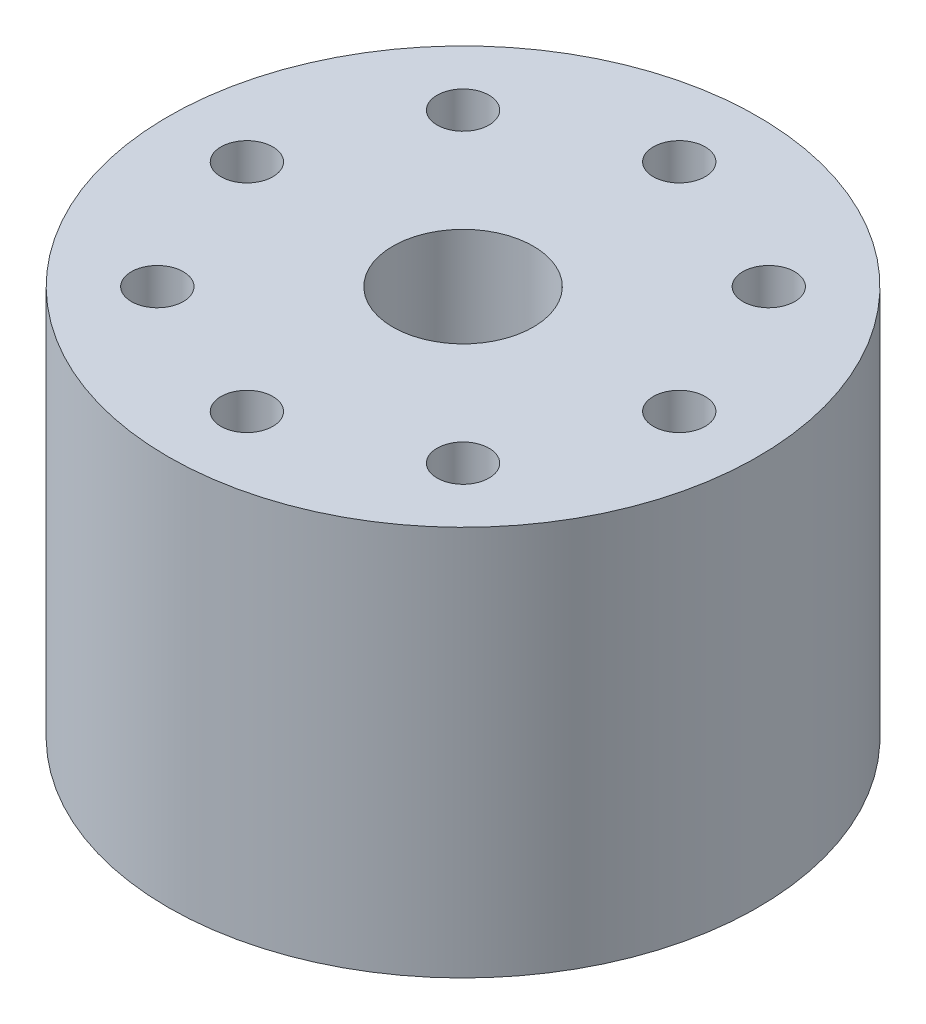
from build123d import *

# Parameters (mm, degrees)
SKETCH1_R                    = 37.5
OUTER_CYLINDER_DEPTH         = 49.65
SKETCH2_R                    = 8.93
NPT_HOLE_DEPTH               = 23
SKETCH3_R                    = 15
OUTER_LEAFLET_DIAMETER_DEPTH = 5
SKETCH4_R                    = 19
DEPTH_DEPTH                  = 3.15
SKETCH8_W                    = 15
SKETCH8_H                    = 2.2
SKETCH9_R                    = 3.3
BOLT_HOLES_DEPTH             = 73.647247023
CHAMFER3_SIZE                = 6
CHAMFER3_SIZE2               = 5.034597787


with BuildPart() as part:
    # Sketch1 → Outer Cylinder (new body)
    with BuildSketch(Plane(origin=(0, 0, 0), x_dir=(1, 0, 0), z_dir=(0, 1, 0))):
        with Locations(Location((0, 0, 0), (0, 0, 270))):
            Circle(SKETCH1_R)
    extrude(amount=OUTER_CYLINDER_DEPTH)

    # Sketch2 → NPT Hole (cut)
    with BuildSketch(Plane(origin=(0, 49.65, 0), x_dir=(1, 0, 0), z_dir=(0, 1, 0))):
        with Locations(Location((0, 0, 0), (0, 0, 270))):
            Circle(SKETCH2_R)
    extrude(amount=-NPT_HOLE_DEPTH, mode=Mode.SUBTRACT)

    # Sketch3 → Outer Leaflet Diameter (cut)
    with BuildSketch(Plane.XZ):
        with Locations(Location((0, 0, 0), (0, 0, 270))):
            Circle(SKETCH3_R)
    extrude(amount=-OUTER_LEAFLET_DIAMETER_DEPTH, mode=Mode.SUBTRACT)

    # Sketch4 → Depth (cut)
    with BuildSketch(Plane.XZ):
        with Locations(Location((0, 0, 0), (0, 0, 270))):
            Circle(SKETCH4_R)
    extrude(amount=-DEPTH_DEPTH, mode=Mode.SUBTRACT)

    # Sketch6 → Aortic Root (revolve, cut)
    with BuildSketch(Plane.XY):
        with BuildLine():
            Line((0, 3.15), (-15, 3.15))
            add(Edge.make_bspline(
                [(-15, 24.45), (-24, 13.8), (-15, 3.15)],
                knots=[0, 0, 0, 1, 1, 1], degree=2))
            Line((-15, 24.45), (0, 24.45))
            Line((0, 24.45), (0, 3.15))
        make_face()
    revolve(axis=Axis((0, 3.15, 0), (0, 1, 0)), mode=Mode.SUBTRACT)

    # Sketch8 → Ascending Aorta (revolve, cut)
    with BuildSketch(Plane.XY):
        with Locations((-7.5, 25.55)):
            Rectangle(SKETCH8_W, SKETCH8_H)
    revolve(axis=Axis((0, 26.65, 0), (0, -1, 0)), mode=Mode.SUBTRACT)

    # Sketch9 → Bolt Holes (cut, through all)
    with BuildSketch(Plane(origin=(0, 49.65, 0), x_dir=(1, 0, 0), z_dir=(0, 1, 0))):
        with Locations(Location((0, -27.5, 0), (0, 0, 270))):
            Circle(SKETCH9_R)
        with Locations(Location((-19.445436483, -19.445436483, 0), (0, 0, 270))):
            Circle(SKETCH9_R)
        with Locations(Location((-27.5, 0, 0), (0, 0, 270))):
            Circle(SKETCH9_R)
        with Locations(Location((-19.445436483, 19.445436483, 0), (0, 0, 270))):
            Circle(SKETCH9_R)
        with Locations(Location((0, 27.5, 0), (0, 0, 270))):
            Circle(SKETCH9_R)
        with Locations(Location((19.445436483, 19.445436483, 0), (0, 0, 270))):
            Circle(SKETCH9_R)
        with Locations(Location((27.5, 0, 0), (0, 0, 270))):
            Circle(SKETCH9_R)
        with Locations(Location((19.445436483, -19.445436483, 0), (0, 0, 270))):
            Circle(SKETCH9_R)
    extrude(amount=-BOLT_HOLES_DEPTH, mode=Mode.SUBTRACT)

    # Chamfer3
    chamfer3_edges = [part.edges().sort_by_distance(p)[0] for p in [
        (0, 26.65, -8.93),
    ]]
    chamfer3_side = [part.faces().sort_by_distance(p)[0] for p in [
        (14.575735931, 26.65, 0),
    ]]
    chamfer(chamfer3_edges, length=CHAMFER3_SIZE, length2=CHAMFER3_SIZE2, reference=chamfer3_side[0])


solid = part.part
